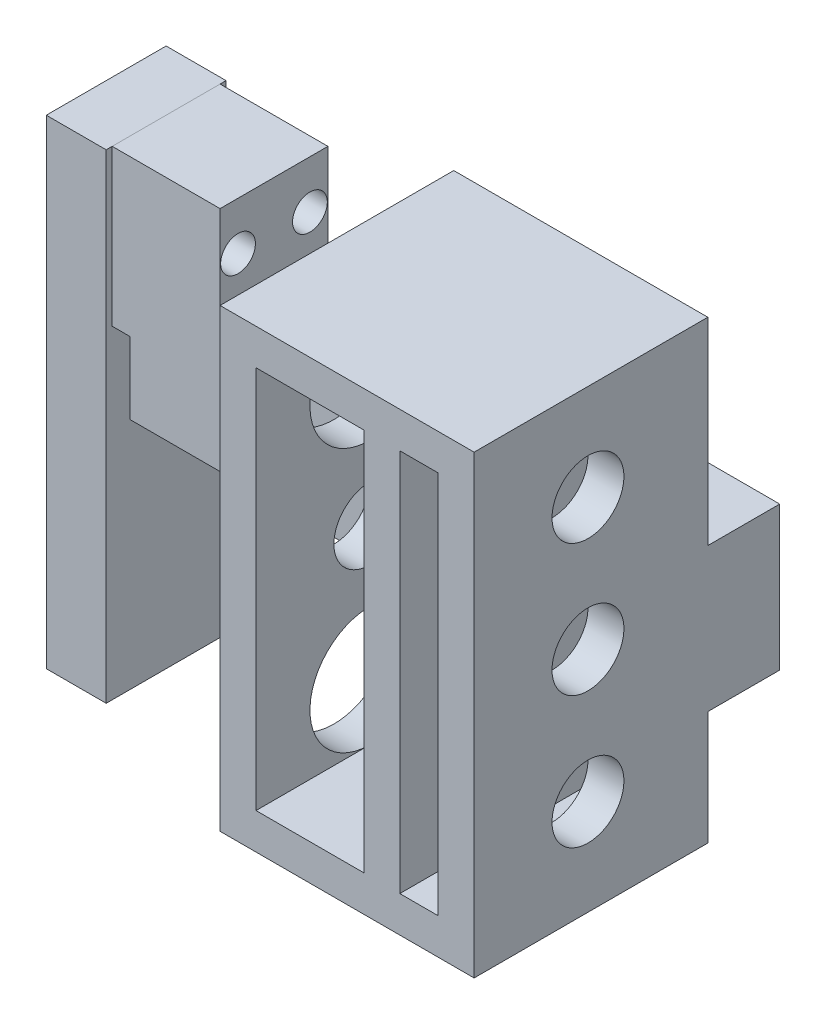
from build123d import *

# Parameters (mm, degrees)
SKETCH_1_W               = 16.5
SKETCH_1_H               = 38
SKETCH_1_R               = 3
EXTRUDE_1_DEPTH          = 3
EXTRUDE_START            = -3.2
SKETCH_2_W               = 16.5
SKETCH_2_H               = 38
SKETCH_2_R               = 4
SKETCH_2_R_2             = 5
EXTRUDE_2_DEPTH          = 3
EXTRUDE_START_2          = -15
SKETCH_3_W               = 16.5
SKETCH_3_H               = 38
SKETCH_3_R               = 3
SKETCH_3_R_2             = 5
EXTRUDE_3_DEPTH          = 3
SKETCH_7_W               = 21.2
SKETCH_7_H               = 3
EXTRUDE_4_DEPTH          = 16.5
EXTRUDE_5_DEPTH          = 3
EXTRUDE_6_DEPTH          = 9
CUT_EXTRUDE_1_DEPTH      = 3.2
EXTRUDE_7_DEPTH          = 9.5
EXTRUDE_7_DEPTH_BACK     = 0.5
SKETCH_11_W              = 5
SKETCH_11_H              = 40
SKETCH_12_R              = 1.45
CUT_EXTRUDE_4_DEPTH      = 57.013748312
CUT_EXTRUDE_5_DEPTH      = 84.713439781
CUT_EXTRUDE_5_DEPTH_BACK = 84.713439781
SKETCH_13_W              = 79.418381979
SKETCH_13_H              = 37.449318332


with BuildPart() as part:
    # Sketch 1 → Extrude 1 (new body)
    with BuildSketch(Plane(origin=(0, 0, 0), x_dir=(0, 0, -1), z_dir=(1, 0, 0))):
        with Locations((8.25, 19)):
            Rectangle(SKETCH_1_W, SKETCH_1_H)
        with Locations((7, 19)):
            Circle(SKETCH_1_R, mode=Mode.SUBTRACT)
        with Locations((7, 30)):
            Circle(SKETCH_1_R, mode=Mode.SUBTRACT)
        with Locations(Location((7, 8, 0), (0, 0, 180))):
            Circle(SKETCH_1_R, mode=Mode.SUBTRACT)
    extrude(amount=EXTRUDE_1_DEPTH)



with BuildPart() as body_2:
    # Sketch 2 → Extrude 2 (new body)
    with BuildSketch(Plane(origin=(0, 0, 0), x_dir=(0, 0, -1), z_dir=(1, 0, 0)).offset(EXTRUDE_START)):
        with Locations((8.25, 19)):
            Rectangle(SKETCH_2_W, SKETCH_2_H)
        with Locations((7, 19)):
            Circle(SKETCH_2_R, mode=Mode.SUBTRACT)
        with Locations((7, 30)):
            Circle(SKETCH_2_R_2, mode=Mode.SUBTRACT)
        with Locations(Location((7, 8, 0), (0, 0, 180))):
            Circle(SKETCH_2_R_2, mode=Mode.SUBTRACT)
    extrude(amount=-EXTRUDE_2_DEPTH)


with BuildPart() as body_3:
    # Sketch 3 → Extrude 3 (new body)
    with BuildSketch(Plane(origin=(-3.2, 0, 0), x_dir=(0, 0, -1), z_dir=(1, 0, 0)).offset(EXTRUDE_START_2)):
        with Locations((8.25, 19)):
            Rectangle(SKETCH_3_W, SKETCH_3_H)
        with Locations((7, 19)):
            Circle(SKETCH_3_R, mode=Mode.SUBTRACT)
        with Locations((7, 30)):
            Circle(SKETCH_3_R_2, mode=Mode.SUBTRACT)
        with Locations(Location((7, 8, 0), (0, 0, 180))):
            Circle(SKETCH_3_R_2, mode=Mode.SUBTRACT)
    extrude(amount=EXTRUDE_3_DEPTH)


with BuildPart() as part_1:
    add(part.part)

    add(body_2.part)  # Extrude 4 merges body 2

    add(body_3.part)  # Extrude 4 merges body 3
    # Sketch 7 → Extrude 4 (add, through all)
    with BuildSketch(Plane.XY):
        with Locations((-7.6, 36.5)):
            Rectangle(SKETCH_7_W, SKETCH_7_H)
        with Locations((-7.6, 1.5)):
            Rectangle(SKETCH_7_W, SKETCH_7_H)
    extrude(amount=-EXTRUDE_4_DEPTH)

    # Sketch 8 → Extrude 5 (add)
    with BuildSketch(Plane.XY):
        Polygon((-43.7, 15.5), (-42.2, 15.5), (-42.2, 9.5), (-18.2, 9.5), (-18.2, 0), (3, 0), (3, 38), (-18.2, 38), (-18.2, 21.5), (-34.7, 21.5), (-34.7, 28.5), (-43.7, 28.5), align=None)
    extrude(amount=EXTRUDE_5_DEPTH)

    # Sketch 9 → Extrude 6 (add)
    with BuildSketch(Plane.XY):
        Polygon((-34.7, 21.5), (-34.7, 28.5), (-43.7, 28.5), (-43.7, 15.5), (-42.2, 15.5), (-42.2, 9.5), (3, 9.5), (3, 21.5), align=None)
    extrude(amount=EXTRUDE_6_DEPTH)

    # Sketch 10 → Cut-Extrude 1 (cut)
    with BuildSketch(Plane(origin=(0, 0, 0), x_dir=(0, 0, -1), z_dir=(1, 0, 0))):
        Polygon((0, 26.487489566), (-3, 26.487489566), (-3, 21.25), (-6, 21.25), (-6, 16.75), (-3, 16.75), (-3, 11.512510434), (0, 11.512510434), (1.798136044, 17.531284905), align=None)
    extrude(amount=-CUT_EXTRUDE_1_DEPTH, mode=Mode.SUBTRACT)


with BuildPart() as body_2_2:
    # Sketch 11 → Extrude 7 (new, two sides: drawn at the far end of the back side and taken through both)
    with BuildSketch(Plane.XY.offset(-EXTRUDE_7_DEPTH_BACK)):
        with Locations((-46.2, 8.5)):
            Rectangle(SKETCH_11_W, SKETCH_11_H)
    extrude(amount=EXTRUDE_7_DEPTH + EXTRUDE_7_DEPTH_BACK)


with BuildPart() as cut_extrude_4_tool:
    # Sketch 12 → Cut-Extrude 4 (new, through all)
    with BuildSketch(Plane(origin=(-34.7, 0, 0), x_dir=(0, 0, -1), z_dir=(1, 0, 0))):
        with Locations(Location((-1.5, 24.5, 0), (0, 0, 90))):
            Circle(SKETCH_12_R)
        with Locations((-7.5, 24.5)):
            Circle(SKETCH_12_R)
    extrude(amount=-CUT_EXTRUDE_4_DEPTH)


with BuildPart() as part_2:
    add(part_1.part)

    # Cut-Extrude 4: cut by cut_extrude_4_tool
    add(cut_extrude_4_tool.part, mode=Mode.SUBTRACT)


with BuildPart() as body_2_2_1:
    add(body_2_2.part)

    # Cut-Extrude 4: cut by cut_extrude_4_tool
    add(cut_extrude_4_tool.part, mode=Mode.SUBTRACT)


with BuildPart() as body_3_2:
    # Mirror 2: mirrored copy
    add(body_2_2_1.part.mirror(Plane.XY.offset(20)))


with BuildPart() as body_4:
    # Mirror 2 2: mirrored copy
    add(part_2.part.mirror(Plane.XY.offset(20)))


with BuildPart() as cut_extrude_5_tool:
    # Sketch 13 → Cut-Extrude 5 (new, two sides: drawn at the far end of the back side and taken through both)
    with BuildSketch(Plane(origin=(0, 0, 0), x_dir=(1, 0, 0), z_dir=(0, 1, 0)).offset(-CUT_EXTRUDE_5_DEPTH_BACK)):
        with Locations((-27.072845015, 6.169222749)):
            Rectangle(SKETCH_13_W, SKETCH_13_H)
    extrude(amount=CUT_EXTRUDE_5_DEPTH + CUT_EXTRUDE_5_DEPTH_BACK)


with BuildPart() as part_3:
    add(part_2.part)

    # Cut-Extrude 5: cut by cut_extrude_5_tool
    add(cut_extrude_5_tool.part, mode=Mode.SUBTRACT)


with BuildPart() as body_2_2_2:
    add(body_2_2_1.part)

    # Cut-Extrude 5: cut by cut_extrude_5_tool
    add(cut_extrude_5_tool.part, mode=Mode.SUBTRACT)


solid = Compound([body_3_2.part, body_4.part])
